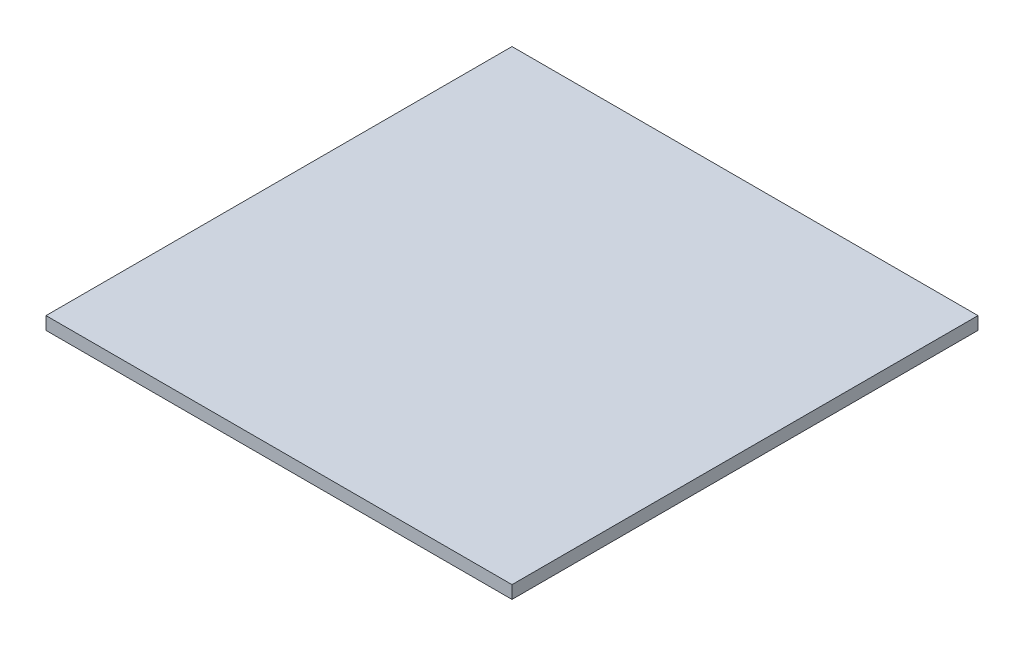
from build123d import *

# Parameters (mm, degrees)
SKETCH1_W           = 431.8
SKETCH1_H           = 431.8
BOSS_EXTRUDE1_DEPTH = 11.90625


with BuildPart() as part:
    # Sketch1 → Boss-Extrude1 (new body)
    with BuildSketch(Plane(origin=(0, 0, 0), x_dir=(1, 0, 0), z_dir=(0, 1, 0))):
        Rectangle(SKETCH1_W, SKETCH1_H)
    extrude(amount=BOSS_EXTRUDE1_DEPTH)


solid = part.part
